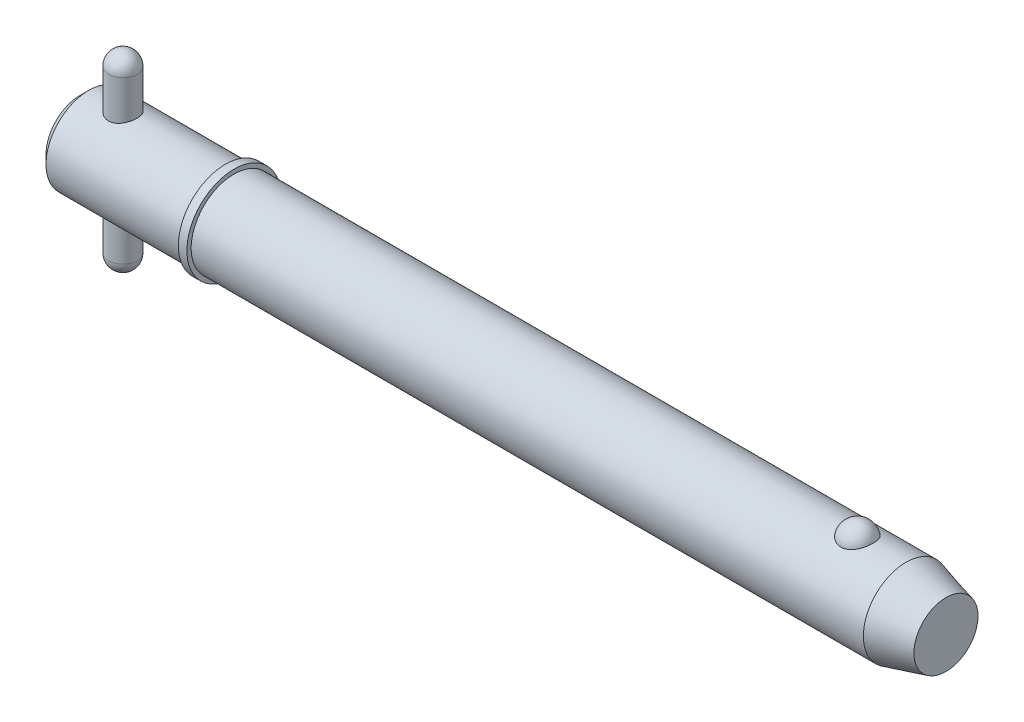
ISO-10303-21;
HEADER;
FILE_DESCRIPTION(('STEP AP214'),'2;1');
FILE_NAME('part.step','',(''),(''),'','','');
FILE_SCHEMA(('AUTOMOTIVE_DESIGN { 1 0 10303 214 1 1 1 1 }'));
ENDSEC;
DATA;
#1=APPLICATION_CONTEXT('core data for automotive mechanical design processes');
#2=APPLICATION_PROTOCOL_DEFINITION('international standard','automotive_design',2000,#1);
#3=PRODUCT_CONTEXT('',#1,'mechanical');
#4=PRODUCT('Part','Part','',(#3));
#5=PRODUCT_RELATED_PRODUCT_CATEGORY('part','',(#4));
#6=PRODUCT_DEFINITION_FORMATION('','',#4);
#7=PRODUCT_DEFINITION_CONTEXT('part definition',#1,'design');
#8=PRODUCT_DEFINITION('design','',#6,#7);
#9=PRODUCT_DEFINITION_SHAPE('','',#8);
#10=(LENGTH_UNIT() NAMED_UNIT(*) SI_UNIT(.MILLI.,.METRE.));
#11=(NAMED_UNIT(*) PLANE_ANGLE_UNIT() SI_UNIT($,.RADIAN.));
#12=(NAMED_UNIT(*) SI_UNIT($,.STERADIAN.) SOLID_ANGLE_UNIT());
#13=UNCERTAINTY_MEASURE_WITH_UNIT(LENGTH_MEASURE(1.E-05),#10,'distance_accuracy_value','');
#14=(GEOMETRIC_REPRESENTATION_CONTEXT(3) GLOBAL_UNCERTAINTY_ASSIGNED_CONTEXT((#13)) GLOBAL_UNIT_ASSIGNED_CONTEXT((#10,
#11,#12)) REPRESENTATION_CONTEXT('',''));
#15=CARTESIAN_POINT('',(0.,0.,0.));
#16=DIRECTION('',(0.,0.,1.));
#17=DIRECTION('',(1.,0.,0.));
#18=AXIS2_PLACEMENT_3D('',#15,#16,#17);
#19=CARTESIAN_POINT('',(7.14,15.875,0.));
#20=DIRECTION('',(0.,-1.,0.));
#21=DIRECTION('',(0.,0.,-1.));
#22=AXIS2_PLACEMENT_3D('',#19,#20,#21);
#23=CYLINDRICAL_SURFACE('',#22,2.38);
#24=CARTESIAN_POINT('',(7.14,-13.495,0.));
#25=DIRECTION('',(0.,-1.,0.));
#26=DIRECTION('',(0.,0.,-1.));
#27=AXIS2_PLACEMENT_3D('',#24,#25,#26);
#28=CIRCLE('',#27,2.38);
#29=CARTESIAN_POINT('',(7.14,-13.495,-2.38));
#30=VERTEX_POINT('',#29);
#31=EDGE_CURVE('P0_E10',#30,#30,#28,.F.);
#32=ORIENTED_EDGE('',*,*,#31,.T.);
#33=EDGE_LOOP('',(#32));
#34=FACE_BOUND('',#33,.T.);
#35=CARTESIAN_POINT('',(7.14,13.495,0.));
#36=DIRECTION('',(0.,-1.,0.));
#37=DIRECTION('',(0.,0.,-1.));
#38=AXIS2_PLACEMENT_3D('',#35,#36,#37);
#39=CIRCLE('',#38,2.38);
#40=CARTESIAN_POINT('',(7.14,13.495,-2.38));
#41=VERTEX_POINT('',#40);
#42=EDGE_CURVE('P0_E21',#41,#41,#39,.T.);
#43=ORIENTED_EDGE('',*,*,#42,.T.);
#44=EDGE_LOOP('',(#43));
#45=FACE_BOUND('',#44,.T.);
#46=ADVANCED_FACE('P0_F14',(#34,#45),#23,.T.);
#47=CARTESIAN_POINT('',(7.14,-13.495,0.));
#48=DIRECTION('',(0.,0.,1.));
#49=DIRECTION('',(1.,0.,0.));
#50=AXIS2_PLACEMENT_3D('',#47,#48,#49);
#51=SPHERICAL_SURFACE('',#50,2.38);
#52=CARTESIAN_POINT('',(7.14,-13.495,0.));
#53=DIRECTION('',(0.,-1.,0.));
#54=DIRECTION('',(0.,0.,-1.));
#55=AXIS2_PLACEMENT_3D('',#52,#53,#54);
#56=SPHERICAL_SURFACE('',#55,2.38);
#57=ORIENTED_EDGE('',*,*,#31,.F.);
#58=EDGE_LOOP('',(#57));
#59=FACE_BOUND('',#58,.T.);
#60=ADVANCED_FACE('P0_F29',(#59),#56,.T.);
#61=CARTESIAN_POINT('',(7.14,13.495,0.));
#62=DIRECTION('',(0.,0.,1.));
#63=DIRECTION('',(1.,0.,0.));
#64=AXIS2_PLACEMENT_3D('',#61,#62,#63);
#65=SPHERICAL_SURFACE('',#64,2.38);
#66=CARTESIAN_POINT('',(7.14,13.495,0.));
#67=DIRECTION('',(0.,-1.,0.));
#68=DIRECTION('',(0.,0.,-1.));
#69=AXIS2_PLACEMENT_3D('',#66,#67,#68);
#70=SPHERICAL_SURFACE('',#69,2.38);
#71=ORIENTED_EDGE('',*,*,#42,.F.);
#72=EDGE_LOOP('',(#71));
#73=FACE_BOUND('',#72,.T.);
#74=ADVANCED_FACE('P0_F16',(#73),#70,.T.);
#75=CLOSED_SHELL('',(#46,#60,#74));
#76=MANIFOLD_SOLID_BREP('P0_B1',#75);
#77=CARTESIAN_POINT('',(0.,0.,0.));
#78=DIRECTION('',(1.,0.,0.));
#79=DIRECTION('',(0.,0.,-1.));
#80=AXIS2_PLACEMENT_3D('',#77,#78,#79);
#81=CYLINDRICAL_SURFACE('',#80,7.145);
#82=CARTESIAN_POINT('',(138.08362424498,0.,0.));
#83=DIRECTION('',(1.,0.,0.));
#84=DIRECTION('',(0.,0.,-1.));
#85=AXIS2_PLACEMENT_3D('',#82,#83,#84);
#86=CIRCLE('',#85,7.145);
#87=CARTESIAN_POINT('',(138.08362424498,0.,-7.145));
#88=VERTEX_POINT('',#87);
#89=EDGE_CURVE('P1_E81',#88,#88,#86,.T.);
#90=ORIENTED_EDGE('',*,*,#89,.F.);
#91=EDGE_LOOP('',(#90));
#92=FACE_BOUND('',#91,.T.);
#93=CARTESIAN_POINT('',(25.7,0.,0.));
#94=DIRECTION('',(1.,0.,0.));
#95=DIRECTION('',(0.,0.,-1.));
#96=AXIS2_PLACEMENT_3D('',#93,#94,#95);
#97=CIRCLE('',#96,7.145);
#98=CARTESIAN_POINT('',(25.7,0.,-7.145));
#99=VERTEX_POINT('',#98);
#100=EDGE_CURVE('P1_E85',#99,#99,#97,.T.);
#101=ORIENTED_EDGE('',*,*,#100,.T.);
#102=EDGE_LOOP('',(#101));
#103=FACE_BOUND('',#102,.T.);
#104=CARTESIAN_POINT('',(129.939503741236,6.60328629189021,2.72903557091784));
#105=CARTESIAN_POINT('',(129.798315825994,6.60329644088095,2.7290249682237));
#106=CARTESIAN_POINT('',(129.656883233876,6.60799490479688,2.71772840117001));
#107=CARTESIAN_POINT('',(129.377955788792,6.62628236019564,2.6728193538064));
#108=CARTESIAN_POINT('',(129.240472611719,6.63989534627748,2.63914664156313));
#109=CARTESIAN_POINT('',(128.973889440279,6.67440775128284,2.55059642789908));
#110=CARTESIAN_POINT('',(128.844768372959,6.69528793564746,2.49577486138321));
#111=CARTESIAN_POINT('',(128.597869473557,6.74205585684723,2.36651799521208));
#112=CARTESIAN_POINT('',(128.480086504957,6.76794130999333,2.2920916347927));
#113=CARTESIAN_POINT('',(128.25516710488,6.82286177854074,2.12312937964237));
#114=CARTESIAN_POINT('',(128.148440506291,6.85196655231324,2.0280710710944));
#115=CARTESIAN_POINT('',(127.951918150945,6.90970232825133,1.82167822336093));
#116=CARTESIAN_POINT('',(127.862127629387,6.93833318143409,1.71033867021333));
#117=CARTESIAN_POINT('',(127.697667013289,6.9935167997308,1.46891951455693));
#118=CARTESIAN_POINT('',(127.623844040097,7.01992110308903,1.33822781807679));
#119=CARTESIAN_POINT('',(127.498088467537,7.06643385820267,1.0656656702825));
#120=CARTESIAN_POINT('',(127.44615735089,7.08654188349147,0.923794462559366));
#121=CARTESIAN_POINT('',(127.364732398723,7.11862399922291,0.630993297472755));
#122=CARTESIAN_POINT('',(127.335516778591,7.13049704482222,0.479974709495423));
#123=CARTESIAN_POINT('',(127.301174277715,7.14449484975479,0.174782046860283));
#124=CARTESIAN_POINT('',(127.296046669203,7.14661990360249,0.020608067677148));
#125=CARTESIAN_POINT('',(127.309938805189,7.14092465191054,-0.285506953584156));
#126=CARTESIAN_POINT('',(127.328810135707,7.1331654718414,-0.437455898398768));
#127=CARTESIAN_POINT('',(127.390062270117,7.10859076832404,-0.73577860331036));
#128=CARTESIAN_POINT('',(127.432443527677,7.0917750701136,-0.882152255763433));
#129=CARTESIAN_POINT('',(127.539934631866,7.05076716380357,-1.16543149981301));
#130=CARTESIAN_POINT('',(127.605075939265,7.02656475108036,-1.30232366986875));
#131=CARTESIAN_POINT('',(127.756759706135,6.97329145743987,-1.56265907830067));
#132=CARTESIAN_POINT('',(127.843303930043,6.94422017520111,-1.68610120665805));
#133=CARTESIAN_POINT('',(128.036465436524,6.88415108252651,-1.91671004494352));
#134=CARTESIAN_POINT('',(128.143180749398,6.85314438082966,-2.02379244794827));
#135=CARTESIAN_POINT('',(128.373974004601,6.79282069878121,-2.21787433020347));
#136=CARTESIAN_POINT('',(128.498050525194,6.76350358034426,-2.30487545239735));
#137=CARTESIAN_POINT('',(128.757678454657,6.71060580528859,-2.45458647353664));
#138=CARTESIAN_POINT('',(128.892938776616,6.68691885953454,-2.51776240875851));
#139=CARTESIAN_POINT('',(129.173277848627,6.64741247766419,-2.62030218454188));
#140=CARTESIAN_POINT('',(129.318352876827,6.63159007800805,-2.65967499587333));
#141=CARTESIAN_POINT('',(129.606347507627,6.61038594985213,-2.71193301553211));
#142=CARTESIAN_POINT('',(129.74900807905,6.60451880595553,-2.72605165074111));
#143=CARTESIAN_POINT('',(130.034800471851,6.60240611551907,-2.73116688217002));
#144=CARTESIAN_POINT('',(130.177932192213,6.60615862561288,-2.7221681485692));
#145=CARTESIAN_POINT('',(130.455848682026,6.62256094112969,-2.68200435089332));
#146=CARTESIAN_POINT('',(130.590754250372,6.63492533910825,-2.65154998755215));
#147=CARTESIAN_POINT('',(130.85332009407,6.66687445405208,-2.57015684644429));
#148=CARTESIAN_POINT('',(130.98097978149,6.68645975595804,-2.51921640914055));
#149=CARTESIAN_POINT('',(131.228577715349,6.73127274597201,-2.39693610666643));
#150=CARTESIAN_POINT('',(131.348287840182,6.7566138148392,-2.32517694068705));
#151=CARTESIAN_POINT('',(131.574159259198,6.81006003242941,-2.16363812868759));
#152=CARTESIAN_POINT('',(131.680317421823,6.83816581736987,-2.07385432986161));
#153=CARTESIAN_POINT('',(131.881862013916,6.89580469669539,-1.87357235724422));
#154=CARTESIAN_POINT('',(131.976440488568,6.92533863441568,-1.76226074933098));
#155=CARTESIAN_POINT('',(132.146332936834,6.98139526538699,-1.5251169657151));
#156=CARTESIAN_POINT('',(132.221643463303,7.0079174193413,-1.39928219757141));
#157=CARTESIAN_POINT('',(132.353595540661,7.05607625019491,-1.1321597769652));
#158=CARTESIAN_POINT('',(132.409568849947,7.07753119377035,-0.990508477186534));
#159=CARTESIAN_POINT('',(132.498296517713,7.11222355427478,-0.699154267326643));
#160=CARTESIAN_POINT('',(132.531050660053,7.12546089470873,-0.549451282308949));
#161=CARTESIAN_POINT('',(132.572689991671,7.14237584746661,-0.246120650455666));
#162=CARTESIAN_POINT('',(132.581558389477,7.14604673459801,-0.0924903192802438));
#163=CARTESIAN_POINT('',(132.575194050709,7.14343510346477,0.214181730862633));
#164=CARTESIAN_POINT('',(132.559961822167,7.13715279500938,0.367223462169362));
#165=CARTESIAN_POINT('',(132.505845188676,7.1153294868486,0.667595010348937));
#166=CARTESIAN_POINT('',(132.467077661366,7.09983424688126,0.814949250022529));
#167=CARTESIAN_POINT('',(132.366770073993,7.06119140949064,1.1006322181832));
#168=CARTESIAN_POINT('',(132.305228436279,7.03804328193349,1.23896032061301));
#169=CARTESIAN_POINT('',(132.160207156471,6.98632429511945,1.50352300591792));
#170=CARTESIAN_POINT('',(132.076606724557,6.95772382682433,1.62968561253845));
#171=CARTESIAN_POINT('',(131.88938046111,6.89823072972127,1.86554304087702));
#172=CARTESIAN_POINT('',(131.785755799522,6.86733823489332,1.97523882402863));
#173=CARTESIAN_POINT('',(131.561076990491,6.80676456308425,2.174822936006));
#174=CARTESIAN_POINT('',(131.440067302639,6.7770805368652,2.26476035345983));
#175=CARTESIAN_POINT('',(131.183340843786,6.7223050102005,2.42252989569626));
#176=CARTESIAN_POINT('',(131.04761851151,6.69721525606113,2.4903536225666));
#177=CARTESIAN_POINT('',(130.770402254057,6.65552591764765,2.59967646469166));
#178=CARTESIAN_POINT('',(130.629281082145,6.63865794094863,2.6420201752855));
#179=CARTESIAN_POINT('',(130.341444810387,6.61425039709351,2.70255841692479));
#180=CARTESIAN_POINT('',(130.194748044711,6.606682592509,2.72082606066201));
#181=CARTESIAN_POINT('',(130.011679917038,6.60358754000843,2.72830331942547));
#182=CARTESIAN_POINT('',(129.975599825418,6.60328369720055,2.72903828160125));
#183=CARTESIAN_POINT('',(129.939503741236,6.60328629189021,2.72903557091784));
#184=B_SPLINE_CURVE_WITH_KNOTS('',3,(#104,#105,#106,#107,#108,#109,#110,#111,#112,#113,#114,
#115,#116,#117,#118,#119,#120,#121,#122,#123,#124,#125,#126,#127,#128,#129,#130,#131,#132,#133,
#134,#135,#136,#137,#138,#139,#140,#141,#142,#143,#144,#145,#146,#147,#148,#149,#150,#151,#152,
#153,#154,#155,#156,#157,#158,#159,#160,#161,#162,#163,#164,#165,#166,#167,#168,#169,#170,#171,
#172,#173,#174,#175,#176,#177,#178,#179,#180,#181,#182,#183),.UNSPECIFIED.,.T.,.F.,(4,2,2,2,2,2,
2,2,2,2,2,2,2,2,2,2,2,2,2,2,2,2,2,2,2,2,2,2,2,2,2,2,2,2,2,2,2,2,2,4),(0.,0.423468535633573,
0.848081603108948,1.27157926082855,1.69488414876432,2.13051395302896,2.56627819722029,
3.02136706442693,3.47648674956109,3.93709649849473,4.39769233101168,4.85545355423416,
5.31322361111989,5.77162895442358,6.23007210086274,6.6908033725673,7.15149693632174,
7.60264329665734,8.05361952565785,8.48189729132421,8.91008854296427,9.32472524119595,
9.73939553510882,10.1630783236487,10.5868588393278,11.0319070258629,11.4770347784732,
11.9362874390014,12.3955443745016,12.8551240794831,13.3146940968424,13.7720003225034,
14.2293382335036,14.6892343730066,15.1491036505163,15.6078171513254,16.0667046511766,
16.5093965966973,16.9507410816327,17.0590049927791),.UNSPECIFIED.);
#185=CARTESIAN_POINT('',(129.939503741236,6.60328629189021,2.72903557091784));
#186=VERTEX_POINT('',#185);
#187=EDGE_CURVE('P1_E35',#186,#186,#184,.T.);
#188=ORIENTED_EDGE('',*,*,#187,.T.);
#189=EDGE_LOOP('',(#188));
#190=FACE_BOUND('',#189,.T.);
#191=ADVANCED_FACE('P1_F13',(#92,#103,#190),#81,.T.);
#192=CARTESIAN_POINT('',(0.,0.,0.));
#193=DIRECTION('',(-1.,0.,0.));
#194=DIRECTION('',(0.,0.,1.));
#195=AXIS2_PLACEMENT_3D('',#192,#193,#194);
#196=PLANE('',#195);
#197=CARTESIAN_POINT('',(0.,0.,0.));
#198=DIRECTION('',(1.,0.,0.));
#199=DIRECTION('',(0.,0.,-1.));
#200=AXIS2_PLACEMENT_3D('',#197,#198,#199);
#201=CIRCLE('',#200,5.716);
#202=CARTESIAN_POINT('',(0.,0.,-5.716));
#203=VERTEX_POINT('',#202);
#204=EDGE_CURVE('P1_E9',#203,#203,#201,.T.);
#205=ORIENTED_EDGE('',*,*,#204,.F.);
#206=EDGE_LOOP('',(#205));
#207=FACE_BOUND('',#206,.T.);
#208=ADVANCED_FACE('P1_F15',(#207),#196,.T.);
#209=CARTESIAN_POINT('',(1.42899999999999,0.,0.));
#210=DIRECTION('',(1.,0.,0.));
#211=DIRECTION('',(0.,0.,-1.));
#212=AXIS2_PLACEMENT_3D('',#209,#210,#211);
#213=CONICAL_SURFACE('',#212,7.145,0.78539816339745);
#214=ORIENTED_EDGE('',*,*,#204,.T.);
#215=EDGE_LOOP('',(#214));
#216=FACE_BOUND('',#215,.T.);
#217=CARTESIAN_POINT('',(1.42899999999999,0.,0.));
#218=DIRECTION('',(1.,0.,0.));
#219=DIRECTION('',(0.,0.,-1.));
#220=AXIS2_PLACEMENT_3D('',#217,#218,#219);
#221=CIRCLE('',#220,7.145);
#222=CARTESIAN_POINT('',(1.42899999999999,0.,-7.145));
#223=VERTEX_POINT('',#222);
#224=EDGE_CURVE('P1_E26',#223,#223,#221,.T.);
#225=ORIENTED_EDGE('',*,*,#224,.F.);
#226=EDGE_LOOP('',(#225));
#227=FACE_BOUND('',#226,.T.);
#228=ADVANCED_FACE('P1_F77',(#216,#227),#213,.T.);
#229=CARTESIAN_POINT('',(0.,0.,0.));
#230=DIRECTION('',(1.,0.,0.));
#231=DIRECTION('',(0.,0.,-1.));
#232=AXIS2_PLACEMENT_3D('',#229,#230,#231);
#233=CYLINDRICAL_SURFACE('',#232,7.145);
#234=CARTESIAN_POINT('',(7.14,-6.73695962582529,2.38));
#235=CARTESIAN_POINT('',(7.01035997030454,-6.73695921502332,2.38000059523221));
#236=CARTESIAN_POINT('',(6.88072348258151,-6.74074253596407,2.36937183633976));
#237=CARTESIAN_POINT('',(6.62529075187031,-6.75538853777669,2.32728080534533));
#238=CARTESIAN_POINT('',(6.49949514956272,-6.76625239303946,2.29581507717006));
#239=CARTESIAN_POINT('',(6.2554858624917,-6.79369535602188,2.21327763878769));
#240=CARTESIAN_POINT('',(6.13725786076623,-6.81026326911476,2.16224430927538));
#241=CARTESIAN_POINT('',(5.91100349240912,-6.84723128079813,2.04215132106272));
#242=CARTESIAN_POINT('',(5.80297937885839,-6.86763222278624,1.97308769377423));
#243=CARTESIAN_POINT('',(5.59597854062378,-6.91086152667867,1.81600414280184));
#244=CARTESIAN_POINT('',(5.49745861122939,-6.93375032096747,1.72739874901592));
#245=CARTESIAN_POINT('',(5.31636508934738,-6.97886546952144,1.53499636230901));
#246=CARTESIAN_POINT('',(5.23379405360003,-7.00109171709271,1.43119693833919));
#247=CARTESIAN_POINT('',(5.08487013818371,-7.04307708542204,1.20801318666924));
#248=CARTESIAN_POINT('',(5.01899578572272,-7.06275685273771,1.08829330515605));
#249=CARTESIAN_POINT('',(4.90850130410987,-7.09671988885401,0.838703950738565));
#250=CARTESIAN_POINT('',(4.86387545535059,-7.11100460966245,0.70883722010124));
#251=CARTESIAN_POINT('',(4.79869354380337,-7.13213998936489,0.44742990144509));
#252=CARTESIAN_POINT('',(4.77735497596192,-7.13923172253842,0.316104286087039));
#253=CARTESIAN_POINT('',(4.75686536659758,-7.14603777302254,0.0515578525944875));
#254=CARTESIAN_POINT('',(4.75770861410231,-7.14575398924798,-0.0816624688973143));
#255=CARTESIAN_POINT('',(4.78106216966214,-7.13800438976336,-0.340678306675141));
#256=CARTESIAN_POINT('',(4.80272255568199,-7.13082030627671,-0.466560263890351));
#257=CARTESIAN_POINT('',(4.86569013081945,-7.11043095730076,-0.712788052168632));
#258=CARTESIAN_POINT('',(4.90699865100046,-7.09722528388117,-0.833133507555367));
#259=CARTESIAN_POINT('',(5.00858673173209,-7.06591754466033,-1.06673173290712));
#260=CARTESIAN_POINT('',(5.06910834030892,-7.0477534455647,-1.17987058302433));
#261=CARTESIAN_POINT('',(5.20720514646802,-7.00841977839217,-1.39463797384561));
#262=CARTESIAN_POINT('',(5.28478508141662,-6.987249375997,-1.49626330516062));
#263=CARTESIAN_POINT('',(5.4590800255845,-6.94296010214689,-1.69017445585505));
#264=CARTESIAN_POINT('',(5.55652324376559,-6.91979641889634,-1.78179645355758));
#265=CARTESIAN_POINT('',(5.76558873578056,-6.87497076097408,-1.94761348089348));
#266=CARTESIAN_POINT('',(5.87721318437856,-6.85330901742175,-2.02180583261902));
#267=CARTESIAN_POINT('',(6.11357367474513,-6.81369485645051,-2.15157488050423));
#268=CARTESIAN_POINT('',(6.23847358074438,-6.79579956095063,-2.20687188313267));
#269=CARTESIAN_POINT('',(6.49655785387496,-6.76640630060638,-2.29542443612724));
#270=CARTESIAN_POINT('',(6.62973872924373,-6.75490565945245,-2.32868920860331));
#271=CARTESIAN_POINT('',(6.89417536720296,-6.74020933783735,-2.37088225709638));
#272=CARTESIAN_POINT('',(7.02524746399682,-6.73666278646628,-2.38083959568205));
#273=CARTESIAN_POINT('',(7.28721035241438,-6.73729555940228,-2.37904974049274));
#274=CARTESIAN_POINT('',(7.41810117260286,-6.7414734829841,-2.36730648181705));
#275=CARTESIAN_POINT('',(7.67130717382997,-6.75673471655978,-2.32337336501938));
#276=CARTESIAN_POINT('',(7.79376251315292,-6.76757635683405,-2.29189834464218));
#277=CARTESIAN_POINT('',(8.03162917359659,-6.79467771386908,-2.21025275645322));
#278=CARTESIAN_POINT('',(8.14703924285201,-6.8109383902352,-2.16007887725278));
#279=CARTESIAN_POINT('',(8.37159169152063,-6.84768362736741,-2.04065289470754));
#280=CARTESIAN_POINT('',(8.48041962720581,-6.86828569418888,-1.97084668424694));
#281=CARTESIAN_POINT('',(8.68518919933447,-6.91116416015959,-1.8147657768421));
#282=CARTESIAN_POINT('',(8.78112702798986,-6.93344105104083,-1.72848623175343));
#283=CARTESIAN_POINT('',(8.96215574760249,-6.97845348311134,-1.53698616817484));
#284=CARTESIAN_POINT('',(9.04650427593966,-7.00115965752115,-1.43105491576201));
#285=CARTESIAN_POINT('',(9.19627592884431,-7.04341676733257,-1.20598377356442));
#286=CARTESIAN_POINT('',(9.26169972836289,-7.06296781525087,-1.08684435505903));
#287=CARTESIAN_POINT('',(9.37116617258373,-7.0966205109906,-0.83933303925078));
#288=CARTESIAN_POINT('',(9.41534821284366,-7.11075755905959,-0.711027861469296));
#289=CARTESIAN_POINT('',(9.48132660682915,-7.13214194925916,-0.448245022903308));
#290=CARTESIAN_POINT('',(9.50313102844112,-7.13939177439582,-0.313769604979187));
#291=CARTESIAN_POINT('',(9.5230098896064,-7.14599771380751,-0.049254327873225));
#292=CARTESIAN_POINT('',(9.52215013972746,-7.14570837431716,0.0806974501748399));
#293=CARTESIAN_POINT('',(9.49935359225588,-7.13814116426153,0.338518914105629));
#294=CARTESIAN_POINT('',(9.47741850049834,-7.13086385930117,0.466388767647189));
#295=CARTESIAN_POINT('',(9.4138005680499,-7.11026814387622,0.714400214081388));
#296=CARTESIAN_POINT('',(9.37243609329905,-7.09704726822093,0.834632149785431));
#297=CARTESIAN_POINT('',(9.27142829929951,-7.06592602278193,1.06649582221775));
#298=CARTESIAN_POINT('',(9.2117816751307,-7.04802480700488,1.1781259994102));
#299=CARTESIAN_POINT('',(9.07336776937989,-7.00856499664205,1.39411030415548));
#300=CARTESIAN_POINT('',(8.99397590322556,-6.98689577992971,1.49804368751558));
#301=CARTESIAN_POINT('',(8.81938810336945,-6.9426110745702,1.69146078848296));
#302=CARTESIAN_POINT('',(8.72418713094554,-6.91999528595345,1.78093988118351));
#303=CARTESIAN_POINT('',(8.51623540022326,-6.87531507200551,1.94646188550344));
#304=CARTESIAN_POINT('',(8.4029442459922,-6.85330672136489,2.02184316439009));
#305=CARTESIAN_POINT('',(8.16461714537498,-6.81342065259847,2.1524427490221));
#306=CARTESIAN_POINT('',(8.03958429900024,-6.7955418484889,2.20766635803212));
#307=CARTESIAN_POINT('',(7.78712566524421,-6.76686117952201,2.29403636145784));
#308=CARTESIAN_POINT('',(7.66006989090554,-6.75577342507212,2.32616709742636));
#309=CARTESIAN_POINT('',(7.40200728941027,-6.74082409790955,2.36914495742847));
#310=CARTESIAN_POINT('',(7.27100183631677,-6.73696004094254,2.37999939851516));
#311=CARTESIAN_POINT('',(7.14,-6.73695962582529,2.38));
#312=B_SPLINE_CURVE_WITH_KNOTS('',3,(#234,#235,#236,#237,#238,#239,#240,#241,#242,#243,#244,
#245,#246,#247,#248,#249,#250,#251,#252,#253,#254,#255,#256,#257,#258,#259,#260,#261,#262,#263,
#264,#265,#266,#267,#268,#269,#270,#271,#272,#273,#274,#275,#276,#277,#278,#279,#280,#281,#282,
#283,#284,#285,#286,#287,#288,#289,#290,#291,#292,#293,#294,#295,#296,#297,#298,#299,#300,#301,
#302,#303,#304,#305,#306,#307,#308,#309,#310,#311),.UNSPECIFIED.,.T.,.F.,(4,2,2,2,2,2,2,2,2,2,2,
2,2,2,2,2,2,2,2,2,2,2,2,2,2,2,2,2,2,2,2,2,2,2,2,2,2,2,4),(0.,0.388434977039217,
0.776934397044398,1.16467566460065,1.55250234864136,1.9540847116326,2.35573139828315,
2.76784120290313,3.17984001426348,3.57752248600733,3.97510257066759,4.35711073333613,
4.7391447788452,5.12619663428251,5.51335611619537,5.91871976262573,6.3241456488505,
6.73533623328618,7.14635459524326,7.53885245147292,7.93127914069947,8.31025106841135,
8.68929014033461,9.08033871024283,9.47150254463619,9.88145528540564,10.2913934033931,
10.6986033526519,11.1056664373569,11.4936225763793,11.8815473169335,12.2633262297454,
12.645174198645,13.0411187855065,13.437189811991,13.8487371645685,14.2601761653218,
14.6528265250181,15.0453418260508),.UNSPECIFIED.);
#313=CARTESIAN_POINT('',(7.14,-6.73695962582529,2.38));
#314=VERTEX_POINT('',#313);
#315=EDGE_CURVE('P1_E17',#314,#314,#312,.T.);
#316=ORIENTED_EDGE('',*,*,#315,.F.);
#317=EDGE_LOOP('',(#316));
#318=FACE_BOUND('',#317,.T.);
#319=CARTESIAN_POINT('',(7.14,6.73695962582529,2.38));
#320=CARTESIAN_POINT('',(7.26964002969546,6.73695921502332,2.38000059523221));
#321=CARTESIAN_POINT('',(7.39927651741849,6.74074253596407,2.36937183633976));
#322=CARTESIAN_POINT('',(7.65470924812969,6.75538853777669,2.32728080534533));
#323=CARTESIAN_POINT('',(7.78050485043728,6.76625239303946,2.29581507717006));
#324=CARTESIAN_POINT('',(8.02451413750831,6.79369535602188,2.21327763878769));
#325=CARTESIAN_POINT('',(8.14274213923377,6.81026326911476,2.16224430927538));
#326=CARTESIAN_POINT('',(8.36899650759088,6.84723128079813,2.04215132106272));
#327=CARTESIAN_POINT('',(8.47702062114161,6.86763222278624,1.97308769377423));
#328=CARTESIAN_POINT('',(8.68402145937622,6.91086152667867,1.81600414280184));
#329=CARTESIAN_POINT('',(8.78254138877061,6.93375032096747,1.72739874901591));
#330=CARTESIAN_POINT('',(8.96363491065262,6.97886546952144,1.53499636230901));
#331=CARTESIAN_POINT('',(9.04620594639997,7.00109171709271,1.43119693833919));
#332=CARTESIAN_POINT('',(9.19512986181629,7.04307708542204,1.20801318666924));
#333=CARTESIAN_POINT('',(9.26100421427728,7.06275685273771,1.08829330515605));
#334=CARTESIAN_POINT('',(9.37149869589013,7.09671988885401,0.838703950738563));
#335=CARTESIAN_POINT('',(9.41612454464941,7.11100460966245,0.708837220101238));
#336=CARTESIAN_POINT('',(9.48130645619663,7.13213998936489,0.447429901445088));
#337=CARTESIAN_POINT('',(9.50264502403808,7.13923172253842,0.316104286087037));
#338=CARTESIAN_POINT('',(9.52313463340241,7.14603777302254,0.0515578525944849));
#339=CARTESIAN_POINT('',(9.52229138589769,7.14575398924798,-0.0816624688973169));
#340=CARTESIAN_POINT('',(9.49893783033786,7.13800438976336,-0.340678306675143));
#341=CARTESIAN_POINT('',(9.47727744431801,7.13082030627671,-0.466560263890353));
#342=CARTESIAN_POINT('',(9.41430986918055,7.11043095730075,-0.712788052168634));
#343=CARTESIAN_POINT('',(9.37300134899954,7.09722528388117,-0.833133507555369));
#344=CARTESIAN_POINT('',(9.27141326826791,7.06591754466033,-1.06673173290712));
#345=CARTESIAN_POINT('',(9.21089165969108,7.0477534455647,-1.17987058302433));
#346=CARTESIAN_POINT('',(9.07279485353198,7.00841977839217,-1.39463797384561));
#347=CARTESIAN_POINT('',(8.99521491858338,6.987249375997,-1.49626330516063));
#348=CARTESIAN_POINT('',(8.82091997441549,6.94296010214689,-1.69017445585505));
#349=CARTESIAN_POINT('',(8.72347675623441,6.91979641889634,-1.78179645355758));
#350=CARTESIAN_POINT('',(8.51441126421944,6.87497076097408,-1.94761348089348));
#351=CARTESIAN_POINT('',(8.40278681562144,6.85330901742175,-2.02180583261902));
#352=CARTESIAN_POINT('',(8.16642632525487,6.81369485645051,-2.15157488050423));
#353=CARTESIAN_POINT('',(8.04152641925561,6.79579956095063,-2.20687188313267));
#354=CARTESIAN_POINT('',(7.78344214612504,6.76640630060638,-2.29542443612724));
#355=CARTESIAN_POINT('',(7.65026127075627,6.75490565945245,-2.32868920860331));
#356=CARTESIAN_POINT('',(7.38582463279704,6.74020933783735,-2.37088225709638));
#357=CARTESIAN_POINT('',(7.25475253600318,6.73666278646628,-2.38083959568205));
#358=CARTESIAN_POINT('',(6.99278964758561,6.73729555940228,-2.37904974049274));
#359=CARTESIAN_POINT('',(6.86189882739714,6.7414734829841,-2.36730648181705));
#360=CARTESIAN_POINT('',(6.60869282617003,6.75673471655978,-2.32337336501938));
#361=CARTESIAN_POINT('',(6.48623748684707,6.76757635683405,-2.29189834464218));
#362=CARTESIAN_POINT('',(6.2483708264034,6.79467771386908,-2.21025275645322));
#363=CARTESIAN_POINT('',(6.13296075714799,6.8109383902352,-2.16007887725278));
#364=CARTESIAN_POINT('',(5.90840830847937,6.84768362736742,-2.04065289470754));
#365=CARTESIAN_POINT('',(5.79958037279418,6.86828569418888,-1.97084668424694));
#366=CARTESIAN_POINT('',(5.59481080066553,6.91116416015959,-1.8147657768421));
#367=CARTESIAN_POINT('',(5.49887297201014,6.93344105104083,-1.72848623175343));
#368=CARTESIAN_POINT('',(5.31784425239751,6.97845348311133,-1.53698616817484));
#369=CARTESIAN_POINT('',(5.23349572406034,7.00115965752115,-1.43105491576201));
#370=CARTESIAN_POINT('',(5.08372407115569,7.04341676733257,-1.20598377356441));
#371=CARTESIAN_POINT('',(5.01830027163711,7.06296781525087,-1.08684435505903));
#372=CARTESIAN_POINT('',(4.90883382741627,7.0966205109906,-0.839333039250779));
#373=CARTESIAN_POINT('',(4.86465178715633,7.11075755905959,-0.711027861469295));
#374=CARTESIAN_POINT('',(4.79867339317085,7.13214194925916,-0.448245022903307));
#375=CARTESIAN_POINT('',(4.77686897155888,7.13939177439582,-0.313769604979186));
#376=CARTESIAN_POINT('',(4.7569901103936,7.14599771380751,-0.0492543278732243));
#377=CARTESIAN_POINT('',(4.75784986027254,7.14570837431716,0.0806974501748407));
#378=CARTESIAN_POINT('',(4.78064640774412,7.13814116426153,0.33851891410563));
#379=CARTESIAN_POINT('',(4.80258149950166,7.13086385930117,0.46638876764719));
#380=CARTESIAN_POINT('',(4.8661994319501,7.11026814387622,0.714400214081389));
#381=CARTESIAN_POINT('',(4.90756390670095,7.09704726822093,0.834632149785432));
#382=CARTESIAN_POINT('',(5.00857170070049,7.06592602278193,1.06649582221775));
#383=CARTESIAN_POINT('',(5.0682183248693,7.04802480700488,1.1781259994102));
#384=CARTESIAN_POINT('',(5.20663223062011,7.00856499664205,1.39411030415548));
#385=CARTESIAN_POINT('',(5.28602409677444,6.98689577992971,1.49804368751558));
#386=CARTESIAN_POINT('',(5.46061189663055,6.9426110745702,1.69146078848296));
#387=CARTESIAN_POINT('',(5.55581286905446,6.91999528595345,1.78093988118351));
#388=CARTESIAN_POINT('',(5.76376459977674,6.87531507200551,1.94646188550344));
#389=CARTESIAN_POINT('',(5.8770557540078,6.85330672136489,2.02184316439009));
#390=CARTESIAN_POINT('',(6.11538285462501,6.81342065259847,2.1524427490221));
#391=CARTESIAN_POINT('',(6.24041570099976,6.7955418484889,2.20766635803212));
#392=CARTESIAN_POINT('',(6.4928743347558,6.76686117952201,2.29403636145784));
#393=CARTESIAN_POINT('',(6.61993010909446,6.75577342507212,2.32616709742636));
#394=CARTESIAN_POINT('',(6.87799271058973,6.74082409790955,2.36914495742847));
#395=CARTESIAN_POINT('',(7.00899816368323,6.73696004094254,2.37999939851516));
#396=CARTESIAN_POINT('',(7.14,6.73695962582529,2.38));
#397=B_SPLINE_CURVE_WITH_KNOTS('',3,(#319,#320,#321,#322,#323,#324,#325,#326,#327,#328,#329,
#330,#331,#332,#333,#334,#335,#336,#337,#338,#339,#340,#341,#342,#343,#344,#345,#346,#347,#348,
#349,#350,#351,#352,#353,#354,#355,#356,#357,#358,#359,#360,#361,#362,#363,#364,#365,#366,#367,
#368,#369,#370,#371,#372,#373,#374,#375,#376,#377,#378,#379,#380,#381,#382,#383,#384,#385,#386,
#387,#388,#389,#390,#391,#392,#393,#394,#395,#396),.UNSPECIFIED.,.T.,.F.,(4,2,2,2,2,2,2,2,2,2,2,
2,2,2,2,2,2,2,2,2,2,2,2,2,2,2,2,2,2,2,2,2,2,2,2,2,2,2,4),(0.,0.388434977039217,
0.776934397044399,1.16467566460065,1.55250234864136,1.9540847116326,2.35573139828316,
2.76784120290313,3.17984001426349,3.57752248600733,3.97510257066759,4.35711073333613,
4.73914477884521,5.12619663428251,5.51335611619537,5.91871976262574,6.3241456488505,
6.73533623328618,7.14635459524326,7.53885245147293,7.93127914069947,8.31025106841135,
8.68929014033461,9.08033871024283,9.47150254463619,9.88145528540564,10.2913934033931,
10.6986033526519,11.1056664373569,11.4936225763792,11.8815473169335,12.2633262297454,
12.645174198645,13.0411187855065,13.437189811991,13.8487371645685,14.2601761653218,
14.6528265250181,15.0453418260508),.UNSPECIFIED.);
#398=CARTESIAN_POINT('',(7.14,6.73695962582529,2.38));
#399=VERTEX_POINT('',#398);
#400=EDGE_CURVE('P1_E43',#399,#399,#397,.T.);
#401=ORIENTED_EDGE('',*,*,#400,.F.);
#402=EDGE_LOOP('',(#401));
#403=FACE_BOUND('',#402,.T.);
#404=ORIENTED_EDGE('',*,*,#224,.T.);
#405=EDGE_LOOP('',(#404));
#406=FACE_BOUND('',#405,.T.);
#407=CARTESIAN_POINT('',(24.271,0.,0.));
#408=DIRECTION('',(1.,0.,0.));
#409=DIRECTION('',(0.,0.,-1.));
#410=AXIS2_PLACEMENT_3D('',#407,#408,#409);
#411=CIRCLE('',#410,7.145);
#412=CARTESIAN_POINT('',(24.271,0.,-7.145));
#413=VERTEX_POINT('',#412);
#414=EDGE_CURVE('P1_E31',#413,#413,#411,.T.);
#415=ORIENTED_EDGE('',*,*,#414,.F.);
#416=EDGE_LOOP('',(#415));
#417=FACE_BOUND('',#416,.T.);
#418=ADVANCED_FACE('P1_F103',(#318,#403,#406,#417),#233,.T.);
#419=CARTESIAN_POINT('',(24.271,7.145,0.));
#420=DIRECTION('',(-1.,0.,0.));
#421=DIRECTION('',(0.,0.,1.));
#422=AXIS2_PLACEMENT_3D('',#419,#420,#421);
#423=PLANE('',#422);
#424=ORIENTED_EDGE('',*,*,#414,.T.);
#425=EDGE_LOOP('',(#424));
#426=FACE_BOUND('',#425,.T.);
#427=CARTESIAN_POINT('',(24.271,0.,0.));
#428=DIRECTION('',(1.,0.,0.));
#429=DIRECTION('',(0.,0.,-1.));
#430=AXIS2_PLACEMENT_3D('',#427,#428,#429);
#431=CIRCLE('',#430,7.8595);
#432=CARTESIAN_POINT('',(24.271,0.,-7.8595));
#433=VERTEX_POINT('',#432);
#434=EDGE_CURVE('P1_E91',#433,#433,#431,.T.);
#435=ORIENTED_EDGE('',*,*,#434,.F.);
#436=EDGE_LOOP('',(#435));
#437=FACE_BOUND('',#436,.T.);
#438=ADVANCED_FACE('P1_F100',(#426,#437),#423,.T.);
#439=CARTESIAN_POINT('',(0.,0.,0.));
#440=DIRECTION('',(1.,0.,0.));
#441=DIRECTION('',(0.,0.,-1.));
#442=AXIS2_PLACEMENT_3D('',#439,#440,#441);
#443=CYLINDRICAL_SURFACE('',#442,7.8595);
#444=ORIENTED_EDGE('',*,*,#434,.T.);
#445=EDGE_LOOP('',(#444));
#446=FACE_BOUND('',#445,.T.);
#447=CARTESIAN_POINT('',(25.7,0.,0.));
#448=DIRECTION('',(1.,0.,0.));
#449=DIRECTION('',(0.,0.,-1.));
#450=AXIS2_PLACEMENT_3D('',#447,#448,#449);
#451=CIRCLE('',#450,7.8595);
#452=CARTESIAN_POINT('',(25.7,0.,-7.8595));
#453=VERTEX_POINT('',#452);
#454=EDGE_CURVE('P1_E88',#453,#453,#451,.T.);
#455=ORIENTED_EDGE('',*,*,#454,.F.);
#456=EDGE_LOOP('',(#455));
#457=FACE_BOUND('',#456,.T.);
#458=ADVANCED_FACE('P1_F68',(#446,#457),#443,.T.);
#459=CARTESIAN_POINT('',(25.7,7.8595,0.));
#460=DIRECTION('',(1.,0.,0.));
#461=DIRECTION('',(0.,0.,-1.));
#462=AXIS2_PLACEMENT_3D('',#459,#460,#461);
#463=PLANE('',#462);
#464=ORIENTED_EDGE('',*,*,#454,.T.);
#465=EDGE_LOOP('',(#464));
#466=FACE_BOUND('',#465,.T.);
#467=ORIENTED_EDGE('',*,*,#100,.F.);
#468=EDGE_LOOP('',(#467));
#469=FACE_BOUND('',#468,.T.);
#470=ADVANCED_FACE('P1_F62',(#466,#469),#463,.T.);
#471=CARTESIAN_POINT('',(144.75,0.,0.));
#472=DIRECTION('',(-1.,0.,0.));
#473=DIRECTION('',(0.,0.,1.));
#474=AXIS2_PLACEMENT_3D('',#471,#472,#473);
#475=CONICAL_SURFACE('',#474,5.35875000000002,0.26179938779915);
#476=ORIENTED_EDGE('',*,*,#89,.T.);
#477=EDGE_LOOP('',(#476));
#478=FACE_BOUND('',#477,.T.);
#479=CARTESIAN_POINT('',(144.75,0.,0.));
#480=DIRECTION('',(1.,0.,0.));
#481=DIRECTION('',(0.,0.,-1.));
#482=AXIS2_PLACEMENT_3D('',#479,#480,#481);
#483=CIRCLE('',#482,5.35875000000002);
#484=CARTESIAN_POINT('',(144.75,0.,-5.35875000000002));
#485=VERTEX_POINT('',#484);
#486=EDGE_CURVE('P1_E42',#485,#485,#483,.T.);
#487=ORIENTED_EDGE('',*,*,#486,.F.);
#488=EDGE_LOOP('',(#487));
#489=FACE_BOUND('',#488,.T.);
#490=ADVANCED_FACE('P1_F59',(#478,#489),#475,.T.);
#491=CARTESIAN_POINT('',(144.75,5.35875000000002,0.));
#492=DIRECTION('',(1.,0.,0.));
#493=DIRECTION('',(0.,0.,-1.));
#494=AXIS2_PLACEMENT_3D('',#491,#492,#493);
#495=PLANE('',#494);
#496=ORIENTED_EDGE('',*,*,#486,.T.);
#497=EDGE_LOOP('',(#496));
#498=FACE_BOUND('',#497,.T.);
#499=ADVANCED_FACE('P1_F55',(#498),#495,.T.);
#500=CARTESIAN_POINT('',(129.939503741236,6.4305,0.));
#501=DIRECTION('',(-1.,0.,0.));
#502=DIRECTION('',(0.,-1.,0.));
#503=AXIS2_PLACEMENT_3D('',#500,#501,#502);
#504=SPHERICAL_SURFACE('',#503,2.7345);
#505=ORIENTED_EDGE('',*,*,#187,.F.);
#506=EDGE_LOOP('',(#505));
#507=FACE_BOUND('',#506,.T.);
#508=ADVANCED_FACE('P1_F50',(#507),#504,.T.);
#509=CARTESIAN_POINT('',(7.14,-7.8595,0.));
#510=DIRECTION('',(0.,1.,0.));
#511=DIRECTION('',(0.,0.,1.));
#512=AXIS2_PLACEMENT_3D('',#509,#510,#511);
#513=CYLINDRICAL_SURFACE('',#512,2.38);
#514=ORIENTED_EDGE('',*,*,#315,.T.);
#515=EDGE_LOOP('',(#514));
#516=FACE_BOUND('',#515,.T.);
#517=ORIENTED_EDGE('',*,*,#400,.T.);
#518=EDGE_LOOP('',(#517));
#519=FACE_BOUND('',#518,.T.);
#520=ADVANCED_FACE('P1_F54',(#516,#519),#513,.F.);
#521=CLOSED_SHELL('',(#191,#208,#228,#418,#438,#458,#470,#490,#499,#508,#520));
#522=MANIFOLD_SOLID_BREP('P1_B1',#521);
#523=ADVANCED_BREP_SHAPE_REPRESENTATION('',(#18,#76,#522),#14);
#524=SHAPE_DEFINITION_REPRESENTATION(#9,#523);
ENDSEC;
END-ISO-10303-21;
